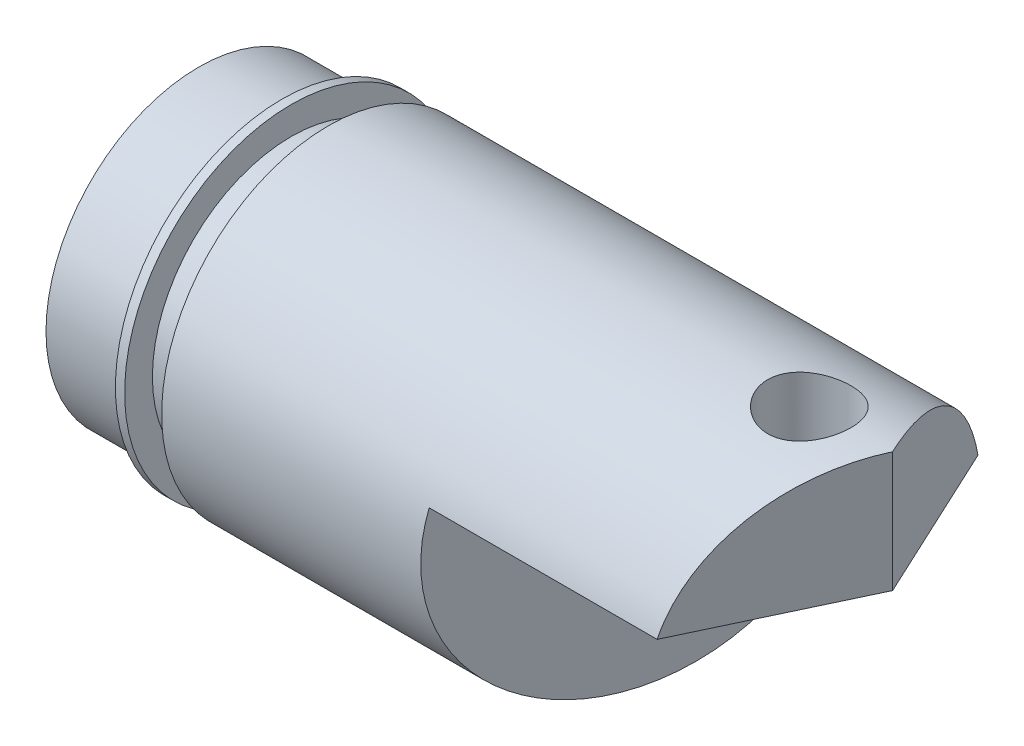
ISO-10303-21;
HEADER;
FILE_DESCRIPTION(('STEP AP214'),'2;1');
FILE_NAME('part.step','',(''),(''),'','','');
FILE_SCHEMA(('AUTOMOTIVE_DESIGN { 1 0 10303 214 1 1 1 1 }'));
ENDSEC;
DATA;
#1=APPLICATION_CONTEXT('core data for automotive mechanical design processes');
#2=APPLICATION_PROTOCOL_DEFINITION('international standard','automotive_design',2000,#1);
#3=PRODUCT_CONTEXT('',#1,'mechanical');
#4=PRODUCT('Part','Part','',(#3));
#5=PRODUCT_RELATED_PRODUCT_CATEGORY('part','',(#4));
#6=PRODUCT_DEFINITION_FORMATION('','',#4);
#7=PRODUCT_DEFINITION_CONTEXT('part definition',#1,'design');
#8=PRODUCT_DEFINITION('design','',#6,#7);
#9=PRODUCT_DEFINITION_SHAPE('','',#8);
#10=(LENGTH_UNIT() NAMED_UNIT(*) SI_UNIT(.MILLI.,.METRE.));
#11=(NAMED_UNIT(*) PLANE_ANGLE_UNIT() SI_UNIT($,.RADIAN.));
#12=(NAMED_UNIT(*) SI_UNIT($,.STERADIAN.) SOLID_ANGLE_UNIT());
#13=UNCERTAINTY_MEASURE_WITH_UNIT(LENGTH_MEASURE(1.E-05),#10,'distance_accuracy_value','');
#14=(GEOMETRIC_REPRESENTATION_CONTEXT(3) GLOBAL_UNCERTAINTY_ASSIGNED_CONTEXT((#13)) GLOBAL_UNIT_ASSIGNED_CONTEXT((#10,
#11,#12)) REPRESENTATION_CONTEXT('',''));
#15=CARTESIAN_POINT('',(0.,0.,0.));
#16=DIRECTION('',(0.,0.,1.));
#17=DIRECTION('',(1.,0.,0.));
#18=AXIS2_PLACEMENT_3D('',#15,#16,#17);
#19=CARTESIAN_POINT('',(150.,0.,0.));
#20=DIRECTION('',(1.,0.,0.));
#21=DIRECTION('',(0.,1.,0.));
#22=AXIS2_PLACEMENT_3D('',#19,#20,#21);
#23=CYLINDRICAL_SURFACE('',#22,36.);
#24=CARTESIAN_POINT('',(28.,0.,0.));
#25=DIRECTION('',(1.,0.,0.));
#26=DIRECTION('',(0.,1.,0.));
#27=AXIS2_PLACEMENT_3D('',#24,#25,#26);
#28=CIRCLE('',#27,36.);
#29=CARTESIAN_POINT('',(28.,36.,0.));
#30=VERTEX_POINT('',#29);
#31=EDGE_CURVE('E148',#30,#30,#28,.T.);
#32=ORIENTED_EDGE('',*,*,#31,.T.);
#33=EDGE_LOOP('',(#32));
#34=FACE_BOUND('',#33,.T.);
#35=CARTESIAN_POINT('',(123.,36.,0.));
#36=CARTESIAN_POINT('',(122.999992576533,36.0000044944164,-0.248708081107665));
#37=CARTESIAN_POINT('',(123.010310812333,35.997418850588,-0.497334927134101));
#38=CARTESIAN_POINT('',(123.05147979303,35.9871583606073,-0.992847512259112));
#39=CARTESIAN_POINT('',(123.082332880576,35.9794829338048,-1.23973304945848));
#40=CARTESIAN_POINT('',(123.164333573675,35.9592469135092,-1.72997199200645));
#41=CARTESIAN_POINT('',(123.215487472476,35.9466848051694,-1.97332427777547));
#42=CARTESIAN_POINT('',(123.337685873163,35.9170178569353,-2.45479492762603));
#43=CARTESIAN_POINT('',(123.408737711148,35.8999113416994,-2.69291132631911));
#44=CARTESIAN_POINT('',(123.570025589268,35.8616556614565,-3.16178775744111));
#45=CARTESIAN_POINT('',(123.660230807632,35.8405129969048,-3.39255893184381));
#46=CARTESIAN_POINT('',(123.859237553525,35.7947291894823,-3.8456782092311));
#47=CARTESIAN_POINT('',(123.968046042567,35.770086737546,-4.06802312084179));
#48=CARTESIAN_POINT('',(124.203389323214,35.7179784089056,-4.50265606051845));
#49=CARTESIAN_POINT('',(124.329916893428,35.6905136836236,-4.71494813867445));
#50=CARTESIAN_POINT('',(124.59990594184,35.6334671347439,-5.12831149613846));
#51=CARTESIAN_POINT('',(124.743375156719,35.6038843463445,-5.3293775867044));
#52=CARTESIAN_POINT('',(125.049040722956,35.5428333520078,-5.72252606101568));
#53=CARTESIAN_POINT('',(125.211534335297,35.5113403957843,-5.91437353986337));
#54=CARTESIAN_POINT('',(125.551872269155,35.4478549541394,-6.2836834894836));
#55=CARTESIAN_POINT('',(125.729709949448,35.4158626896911,-6.46115211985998));
#56=CARTESIAN_POINT('',(126.099727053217,35.3522276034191,-6.80072543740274));
#57=CARTESIAN_POINT('',(126.291913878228,35.3205849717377,-6.96282209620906));
#58=CARTESIAN_POINT('',(126.689224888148,35.2585571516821,-7.27040301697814));
#59=CARTESIAN_POINT('',(126.894344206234,35.2281714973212,-7.41589347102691));
#60=CARTESIAN_POINT('',(127.319482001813,35.1690527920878,-7.69141658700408));
#61=CARTESIAN_POINT('',(127.539680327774,35.1403521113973,-7.82117889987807));
#62=CARTESIAN_POINT('',(127.990522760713,35.0859781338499,-8.06159605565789));
#63=CARTESIAN_POINT('',(128.221162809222,35.0603036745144,-8.17225824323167));
#64=CARTESIAN_POINT('',(128.691379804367,35.0127442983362,-8.37367623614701));
#65=CARTESIAN_POINT('',(128.930957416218,34.9908596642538,-8.46443055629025));
#66=CARTESIAN_POINT('',(129.417309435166,34.9515601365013,-8.62527138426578));
#67=CARTESIAN_POINT('',(129.66408366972,34.9341451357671,-8.69535838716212));
#68=CARTESIAN_POINT('',(130.158003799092,34.9046329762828,-8.81307024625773));
#69=CARTESIAN_POINT('',(130.405043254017,34.8924362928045,-8.86111688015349));
#70=CARTESIAN_POINT('',(130.902476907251,34.8732389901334,-8.93637036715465));
#71=CARTESIAN_POINT('',(131.152871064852,34.8662383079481,-8.96357747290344));
#72=CARTESIAN_POINT('',(131.655115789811,34.8576521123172,-8.99690984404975));
#73=CARTESIAN_POINT('',(131.906966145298,34.8560658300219,-9.00303810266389));
#74=CARTESIAN_POINT('',(132.410267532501,34.8583561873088,-8.99416620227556));
#75=CARTESIAN_POINT('',(132.66171856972,34.8622327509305,-8.97916633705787));
#76=CARTESIAN_POINT('',(133.156210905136,34.8751663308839,-8.92879753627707));
#77=CARTESIAN_POINT('',(133.399307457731,34.8840943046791,-8.89393583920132));
#78=CARTESIAN_POINT('',(133.881709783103,34.9067723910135,-8.80450832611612));
#79=CARTESIAN_POINT('',(134.121014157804,34.9205242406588,-8.74993541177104));
#80=CARTESIAN_POINT('',(134.59405540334,34.9524453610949,-8.62153887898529));
#81=CARTESIAN_POINT('',(134.827793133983,34.9706139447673,-8.54771825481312));
#82=CARTESIAN_POINT('',(135.288184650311,35.0108492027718,-8.38139323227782));
#83=CARTESIAN_POINT('',(135.514838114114,35.0329160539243,-8.28888798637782));
#84=CARTESIAN_POINT('',(135.961813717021,35.0805656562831,-8.08486184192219));
#85=CARTESIAN_POINT('',(136.182049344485,35.1061815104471,-7.97315919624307));
#86=CARTESIAN_POINT('',(136.612364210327,35.1600387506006,-7.73219945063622));
#87=CARTESIAN_POINT('',(136.822443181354,35.1882802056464,-7.60294188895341));
#88=CARTESIAN_POINT('',(137.231142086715,35.2466158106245,-7.32774541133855));
#89=CARTESIAN_POINT('',(137.4297604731,35.2767102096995,-7.18180424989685));
#90=CARTESIAN_POINT('',(137.814271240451,35.3379359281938,-6.87421762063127));
#91=CARTESIAN_POINT('',(138.000163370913,35.3690672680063,-6.71257184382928));
#92=CARTESIAN_POINT('',(138.363173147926,35.4324303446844,-6.36978113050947));
#93=CARTESIAN_POINT('',(138.539888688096,35.4646681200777,-6.18821121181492));
#94=CARTESIAN_POINT('',(138.877440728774,35.528463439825,-5.81075838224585));
#95=CARTESIAN_POINT('',(139.038277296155,35.5600209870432,-5.6148755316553));
#96=CARTESIAN_POINT('',(139.342977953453,35.6215812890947,-5.21007238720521));
#97=CARTESIAN_POINT('',(139.486840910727,35.6515839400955,-5.0011512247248));
#98=CARTESIAN_POINT('',(139.756548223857,35.7091959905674,-4.57167947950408));
#99=CARTESIAN_POINT('',(139.882393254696,35.7368054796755,-4.35112933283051));
#100=CARTESIAN_POINT('',(140.115560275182,35.7889557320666,-3.89905149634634));
#101=CARTESIAN_POINT('',(140.222812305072,35.813484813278,-3.66748635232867));
#102=CARTESIAN_POINT('',(140.417339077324,35.8586481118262,-3.1958482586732));
#103=CARTESIAN_POINT('',(140.504621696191,35.8792838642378,-2.9557787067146));
#104=CARTESIAN_POINT('',(140.658547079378,35.9160806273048,-2.4687616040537));
#105=CARTESIAN_POINT('',(140.725188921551,35.9322414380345,-2.22181374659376));
#106=CARTESIAN_POINT('',(140.837253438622,35.9596175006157,-1.72288121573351));
#107=CARTESIAN_POINT('',(140.882676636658,35.9708328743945,-1.47089666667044));
#108=CARTESIAN_POINT('',(140.951017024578,35.9877707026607,-0.970294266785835));
#109=CARTESIAN_POINT('',(140.974480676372,35.9936264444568,-0.721755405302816));
#110=CARTESIAN_POINT('',(141.000681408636,36.0001680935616,-0.223521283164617));
#111=CARTESIAN_POINT('',(141.003418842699,36.0008540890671,0.0261739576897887));
#112=CARTESIAN_POINT('',(140.988144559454,35.997037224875,0.52486719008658));
#113=CARTESIAN_POINT('',(140.970134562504,35.9925347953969,0.773865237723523));
#114=CARTESIAN_POINT('',(140.913523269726,35.9784678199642,1.2693632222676));
#115=CARTESIAN_POINT('',(140.874922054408,35.9689032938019,1.51586316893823));
#116=CARTESIAN_POINT('',(140.778189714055,35.9451589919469,2.00090506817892));
#117=CARTESIAN_POINT('',(140.720361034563,35.9310507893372,2.23951094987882));
#118=CARTESIAN_POINT('',(140.585483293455,35.8985548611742,2.71101953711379));
#119=CARTESIAN_POINT('',(140.508427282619,35.8801655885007,2.94392014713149));
#120=CARTESIAN_POINT('',(140.335725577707,35.8396049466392,3.40230033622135));
#121=CARTESIAN_POINT('',(140.240085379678,35.8174346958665,3.62778208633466));
#122=CARTESIAN_POINT('',(140.030868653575,35.7698822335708,4.07001336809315));
#123=CARTESIAN_POINT('',(139.917285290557,35.744498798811,4.28675953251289));
#124=CARTESIAN_POINT('',(139.670892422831,35.6907255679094,4.71372564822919));
#125=CARTESIAN_POINT('',(139.537783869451,35.6622912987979,4.92376743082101));
#126=CARTESIAN_POINT('',(139.254728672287,35.6035380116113,5.33203934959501));
#127=CARTESIAN_POINT('',(139.104774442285,35.5732181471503,5.5302641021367));
#128=CARTESIAN_POINT('',(138.789059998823,35.511510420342,5.91357111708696));
#129=CARTESIAN_POINT('',(138.623297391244,35.4801223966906,6.09865138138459));
#130=CARTESIAN_POINT('',(138.277141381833,35.4171365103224,6.45438329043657));
#131=CARTESIAN_POINT('',(138.096754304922,35.3855387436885,6.625041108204));
#132=CARTESIAN_POINT('',(137.717750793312,35.3221872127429,6.95499967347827));
#133=CARTESIAN_POINT('',(137.518791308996,35.2904493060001,7.11390970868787));
#134=CARTESIAN_POINT('',(137.108041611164,35.2285522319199,7.41435316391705));
#135=CARTESIAN_POINT('',(136.896256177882,35.1983924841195,7.55589299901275));
#136=CARTESIAN_POINT('',(136.46112296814,35.1405053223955,7.82069490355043));
#137=CARTESIAN_POINT('',(136.237770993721,35.1127788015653,7.94395027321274));
#138=CARTESIAN_POINT('',(135.781190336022,35.0606046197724,8.17114386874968));
#139=CARTESIAN_POINT('',(135.547965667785,35.0361556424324,8.27508985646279));
#140=CARTESIAN_POINT('',(135.074567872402,34.9913957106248,8.46235474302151));
#141=CARTESIAN_POINT('',(134.834442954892,34.9710615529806,8.5457899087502));
#142=CARTESIAN_POINT('',(134.347674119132,34.934977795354,8.69212361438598));
#143=CARTESIAN_POINT('',(134.101030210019,34.9192281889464,8.75502218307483));
#144=CARTESIAN_POINT('',(133.603082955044,34.8928084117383,8.85973145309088));
#145=CARTESIAN_POINT('',(133.351780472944,34.8821373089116,8.90154602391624));
#146=CARTESIAN_POINT('',(132.846367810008,34.8662093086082,8.96373158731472));
#147=CARTESIAN_POINT('',(132.592257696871,34.8609522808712,8.98410309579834));
#148=CARTESIAN_POINT('',(132.090497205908,34.8560908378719,9.00294499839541));
#149=CARTESIAN_POINT('',(131.842871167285,34.856328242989,9.00202825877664));
#150=CARTESIAN_POINT('',(131.348600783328,34.8620604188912,8.97980375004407));
#151=CARTESIAN_POINT('',(131.101956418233,34.8675550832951,8.95849639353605));
#152=CARTESIAN_POINT('',(130.611432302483,34.8836355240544,8.89567423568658));
#153=CARTESIAN_POINT('',(130.367552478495,34.8942211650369,8.85415997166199));
#154=CARTESIAN_POINT('',(129.88427908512,34.9201667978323,8.7512719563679));
#155=CARTESIAN_POINT('',(129.644885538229,34.935526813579,8.68989810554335));
#156=CARTESIAN_POINT('',(129.173704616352,34.970460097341,8.54822807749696));
#157=CARTESIAN_POINT('',(128.941879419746,34.9900067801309,8.46805100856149));
#158=CARTESIAN_POINT('',(128.485757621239,35.0328177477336,8.289157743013));
#159=CARTESIAN_POINT('',(128.261463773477,35.0560833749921,8.19043484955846));
#160=CARTESIAN_POINT('',(127.821961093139,35.105673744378,7.97520272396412));
#161=CARTESIAN_POINT('',(127.606751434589,35.1319982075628,7.85869511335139));
#162=CARTESIAN_POINT('',(127.186739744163,35.1869878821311,7.60869624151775));
#163=CARTESIAN_POINT('',(126.981938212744,35.2156532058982,7.47520416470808));
#164=CARTESIAN_POINT('',(126.5788222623,35.2753227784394,7.18843517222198));
#165=CARTESIAN_POINT('',(126.380816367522,35.3063685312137,7.03473303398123));
#166=CARTESIAN_POINT('',(125.998377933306,35.369250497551,6.71142551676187));
#167=CARTESIAN_POINT('',(125.813945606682,35.401086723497,6.54181988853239));
#168=CARTESIAN_POINT('',(125.459807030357,35.4646833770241,6.18777665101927));
#169=CARTESIAN_POINT('',(125.290104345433,35.4964437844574,6.00333547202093));
#170=CARTESIAN_POINT('',(124.966599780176,35.5590147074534,5.62085561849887));
#171=CARTESIAN_POINT('',(124.812797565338,35.5898252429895,5.42281723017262));
#172=CARTESIAN_POINT('',(124.519465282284,35.6502091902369,5.0106629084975));
#173=CARTESIAN_POINT('',(124.380249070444,35.6797495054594,4.79631855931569));
#174=CARTESIAN_POINT('',(124.120460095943,35.7361311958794,4.35638506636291));
#175=CARTESIAN_POINT('',(123.999880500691,35.7629735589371,4.13080008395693));
#176=CARTESIAN_POINT('',(123.778275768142,35.8131971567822,3.66995539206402));
#177=CARTESIAN_POINT('',(123.677242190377,35.8365798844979,3.43469991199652));
#178=CARTESIAN_POINT('',(123.495500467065,35.8792244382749,2.95618502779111));
#179=CARTESIAN_POINT('',(123.414789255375,35.8984868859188,2.71292683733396));
#180=CARTESIAN_POINT('',(123.230650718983,35.9428574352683,2.06666445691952));
#181=CARTESIAN_POINT('',(123.144306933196,35.9641522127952,1.65838720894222));
#182=CARTESIAN_POINT('',(123.028989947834,35.9927192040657,0.833330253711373));
#183=CARTESIAN_POINT('',(123.000012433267,35.9999924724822,0.416551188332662));
#184=CARTESIAN_POINT('',(123.,36.,0.));
#185=B_SPLINE_CURVE_WITH_KNOTS('',3,(#35,#36,#37,#38,#39,#40,#41,#42,#43,#44,#45,#46,#47,#48,
#49,#50,#51,#52,#53,#54,#55,#56,#57,#58,#59,#60,#61,#62,#63,#64,#65,#66,#67,#68,#69,#70,#71,#72,
#73,#74,#75,#76,#77,#78,#79,#80,#81,#82,#83,#84,#85,#86,#87,#88,#89,#90,#91,#92,#93,#94,#95,#96,
#97,#98,#99,#100,#101,#102,#103,#104,#105,#106,#107,#108,#109,#110,#111,#112,#113,#114,#115,
#116,#117,#118,#119,#120,#121,#122,#123,#124,#125,#126,#127,#128,#129,#130,#131,#132,#133,#134,
#135,#136,#137,#138,#139,#140,#141,#142,#143,#144,#145,#146,#147,#148,#149,#150,#151,#152,#153,
#154,#155,#156,#157,#158,#159,#160,#161,#162,#163,#164,#165,#166,#167,#168,#169,#170,#171,#172,
#173,#174,#175,#176,#177,#178,#179,#180,#181,#182,#183,#184),.UNSPECIFIED.,.T.,.F.,(4,2,2,2,2,2,
2,2,2,2,2,2,2,2,2,2,2,2,2,2,2,2,2,2,2,2,2,2,2,2,2,2,2,2,2,2,2,2,2,2,2,2,2,2,2,2,2,2,2,2,2,2,2,2,
2,2,2,2,2,2,2,2,2,2,2,2,2,2,2,2,2,2,2,2,4),(0.,0.745757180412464,1.49159945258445,
2.23767311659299,2.98402221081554,3.72917925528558,4.4746157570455,5.21974933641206,
5.96522451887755,6.72448606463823,7.4834206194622,8.24274938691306,9.00179408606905,
9.77244404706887,10.5427970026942,11.3132074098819,12.0835993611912,12.8385611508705,
13.5935137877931,14.3483592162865,15.1031941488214,15.8395645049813,16.57620030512,
17.3127215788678,18.0492762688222,18.7932326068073,19.5372085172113,20.2812846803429,
21.0253754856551,21.790712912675,22.5560471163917,23.321432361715,24.0867889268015,
24.8549655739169,25.6228387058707,26.3907461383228,27.1586346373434,27.9068622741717,
28.6550771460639,29.4032299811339,30.1513798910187,30.8882782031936,31.6254432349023,
32.3623905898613,33.0996193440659,33.8496229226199,34.5999656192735,35.3504221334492,
36.1005557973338,36.8694474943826,37.6380543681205,38.4069421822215,39.1755202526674,
39.9396355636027,40.7037498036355,41.4677237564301,42.2316793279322,42.9736694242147,
43.7156445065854,44.4575998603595,45.1995589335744,45.9369393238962,46.6745864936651,
47.4121664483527,48.1497818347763,48.9066360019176,49.6635020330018,50.420550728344,
51.1775834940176,51.9485144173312,52.7191620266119,53.4894761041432,54.2596738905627,
55.5088066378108,56.7578454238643),.UNSPECIFIED.);
#186=CARTESIAN_POINT('',(123.,36.,0.));
#187=VERTEX_POINT('',#186);
#188=EDGE_CURVE('E89',#187,#187,#185,.T.);
#189=ORIENTED_EDGE('',*,*,#188,.T.);
#190=EDGE_LOOP('',(#189));
#191=FACE_BOUND('',#190,.T.);
#192=CARTESIAN_POINT('',(150.,0.,0.));
#193=DIRECTION('',(0.904396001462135,0.,0.426694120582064));
#194=DIRECTION('',(0.426694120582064,0.,-0.904396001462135));
#195=AXIS2_PLACEMENT_3D('',#192,#193,#194);
#196=ELLIPSE('',#195,39.8055718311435,36.);
#197=CARTESIAN_POINT('',(133.683627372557,10.,34.5832329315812));
#198=VERTEX_POINT('',#197);
#199=CARTESIAN_POINT('',(150.,36.,0.));
#200=VERTEX_POINT('',#199);
#201=EDGE_CURVE('E50',#198,#200,#196,.F.);
#202=ORIENTED_EDGE('',*,*,#201,.T.);
#203=CARTESIAN_POINT('',(150.,0.,0.));
#204=DIRECTION('',(0.906307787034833,0.,-0.422618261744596));
#205=DIRECTION('',(0.422618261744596,0.,0.906307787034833));
#206=AXIS2_PLACEMENT_3D('',#203,#204,#205);
#207=ELLIPSE('',#206,39.7216050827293,36.);
#208=CARTESIAN_POINT('',(133.873573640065,10.,-34.5832329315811));
#209=VERTEX_POINT('',#208);
#210=EDGE_CURVE('E78',#200,#209,#207,.F.);
#211=ORIENTED_EDGE('',*,*,#210,.T.);
#212=DIRECTION('',(1.,0.,0.));
#213=VECTOR('',#212,1.);
#214=CARTESIAN_POINT('',(150.,10.,-34.5832329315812));
#215=LINE('',#214,#213);
#216=CARTESIAN_POINT('',(104.586776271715,10.,-34.5832329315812));
#217=VERTEX_POINT('',#216);
#218=EDGE_CURVE('E11',#209,#217,#215,.F.);
#219=ORIENTED_EDGE('',*,*,#218,.T.);
#220=CARTESIAN_POINT('',(94.5000000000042,0.,0.));
#221=DIRECTION('',(-0.96,0.,-0.28));
#222=DIRECTION('',(0.28,0.,-0.96));
#223=AXIS2_PLACEMENT_3D('',#220,#221,#222);
#224=ELLIPSE('',#223,37.5,36.);
#225=CARTESIAN_POINT('',(84.413223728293,9.99999999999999,34.5832329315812));
#226=VERTEX_POINT('',#225);
#227=EDGE_CURVE('E43',#226,#217,#224,.F.);
#228=ORIENTED_EDGE('',*,*,#227,.F.);
#229=DIRECTION('',(1.,0.,0.));
#230=VECTOR('',#229,1.);
#231=CARTESIAN_POINT('',(150.,10.,34.5832329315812));
#232=LINE('',#231,#230);
#233=EDGE_CURVE('E57',#226,#198,#232,.T.);
#234=ORIENTED_EDGE('',*,*,#233,.T.);
#235=EDGE_LOOP('',(#202,#211,#219,#228,#234));
#236=FACE_BOUND('',#235,.T.);
#237=ADVANCED_FACE('F35',(#34,#191,#236),#23,.T.);
#238=CARTESIAN_POINT('',(150.,10.,-36.));
#239=DIRECTION('',(0.,-1.,0.));
#240=DIRECTION('',(0.,0.,-1.));
#241=AXIS2_PLACEMENT_3D('',#238,#239,#240);
#242=PLANE('',#241);
#243=CARTESIAN_POINT('',(132.,10.,0.));
#244=DIRECTION('',(0.,1.,0.));
#245=DIRECTION('',(0.,0.,1.));
#246=AXIS2_PLACEMENT_3D('',#243,#244,#245);
#247=CIRCLE('',#246,9.);
#248=CARTESIAN_POINT('',(132.,10.,9.));
#249=VERTEX_POINT('',#248);
#250=EDGE_CURVE('E86',#249,#249,#247,.T.);
#251=ORIENTED_EDGE('',*,*,#250,.T.);
#252=EDGE_LOOP('',(#251));
#253=FACE_BOUND('',#252,.T.);
#254=ORIENTED_EDGE('',*,*,#218,.F.);
#255=DIRECTION('',(0.422618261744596,0.,0.906307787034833));
#256=VECTOR('',#255,1.);
#257=CARTESIAN_POINT('',(150.,10.,0.));
#258=LINE('',#257,#256);
#259=CARTESIAN_POINT('',(150.,10.,0.));
#260=VERTEX_POINT('',#259);
#261=EDGE_CURVE('E73',#209,#260,#258,.T.);
#262=ORIENTED_EDGE('',*,*,#261,.T.);
#263=DIRECTION('',(-0.426694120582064,0.,0.904396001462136));
#264=VECTOR('',#263,1.);
#265=CARTESIAN_POINT('',(127.125341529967,10.,48.4837935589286));
#266=LINE('',#265,#264);
#267=EDGE_CURVE('E68',#260,#198,#266,.T.);
#268=ORIENTED_EDGE('',*,*,#267,.T.);
#269=ORIENTED_EDGE('',*,*,#233,.F.);
#270=DIRECTION('',(-0.28,0.,0.96));
#271=VECTOR('',#270,1.);
#272=CARTESIAN_POINT('',(105.000000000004,10.,-36.));
#273=LINE('',#272,#271);
#274=EDGE_CURVE('E96',#217,#226,#273,.T.);
#275=ORIENTED_EDGE('',*,*,#274,.F.);
#276=EDGE_LOOP('',(#254,#262,#268,#269,#275));
#277=FACE_BOUND('',#276,.T.);
#278=ADVANCED_FACE('F81',(#253,#277),#242,.T.);
#279=CARTESIAN_POINT('',(150.,0.,0.));
#280=DIRECTION('',(1.,0.,0.));
#281=DIRECTION('',(0.,1.,0.));
#282=AXIS2_PLACEMENT_3D('',#279,#280,#281);
#283=CYLINDRICAL_SURFACE('',#282,33.);
#284=CARTESIAN_POINT('',(0.,0.,0.));
#285=DIRECTION('',(1.,0.,0.));
#286=DIRECTION('',(0.,1.,0.));
#287=AXIS2_PLACEMENT_3D('',#284,#285,#286);
#288=CIRCLE('',#287,33.);
#289=CARTESIAN_POINT('',(0.,33.,0.));
#290=VERTEX_POINT('',#289);
#291=EDGE_CURVE('E153',#290,#290,#288,.T.);
#292=ORIENTED_EDGE('',*,*,#291,.T.);
#293=EDGE_LOOP('',(#292));
#294=FACE_BOUND('',#293,.T.);
#295=CARTESIAN_POINT('',(18.,0.,0.));
#296=DIRECTION('',(1.,0.,0.));
#297=DIRECTION('',(0.,1.,0.));
#298=AXIS2_PLACEMENT_3D('',#295,#296,#297);
#299=CIRCLE('',#298,33.);
#300=CARTESIAN_POINT('',(18.,33.,0.));
#301=VERTEX_POINT('',#300);
#302=EDGE_CURVE('E181',#301,#301,#299,.T.);
#303=ORIENTED_EDGE('',*,*,#302,.F.);
#304=EDGE_LOOP('',(#303));
#305=FACE_BOUND('',#304,.T.);
#306=ADVANCED_FACE('F37',(#294,#305),#283,.T.);
#307=CARTESIAN_POINT('',(0.,21.,0.));
#308=DIRECTION('',(-1.,0.,0.));
#309=DIRECTION('',(0.,-1.,0.));
#310=AXIS2_PLACEMENT_3D('',#307,#308,#309);
#311=PLANE('',#310);
#312=CARTESIAN_POINT('',(0.,0.,0.));
#313=DIRECTION('',(1.,0.,0.));
#314=DIRECTION('',(0.,1.,0.));
#315=AXIS2_PLACEMENT_3D('',#312,#313,#314);
#316=CIRCLE('',#315,21.);
#317=CARTESIAN_POINT('',(0.,21.,0.));
#318=VERTEX_POINT('',#317);
#319=EDGE_CURVE('E156',#318,#318,#316,.T.);
#320=ORIENTED_EDGE('',*,*,#319,.T.);
#321=EDGE_LOOP('',(#320));
#322=FACE_BOUND('',#321,.T.);
#323=ORIENTED_EDGE('',*,*,#291,.F.);
#324=EDGE_LOOP('',(#323));
#325=FACE_BOUND('',#324,.T.);
#326=ADVANCED_FACE('F187',(#322,#325),#311,.T.);
#327=CARTESIAN_POINT('',(150.,0.,0.));
#328=DIRECTION('',(1.,0.,0.));
#329=DIRECTION('',(0.,1.,0.));
#330=AXIS2_PLACEMENT_3D('',#327,#328,#329);
#331=CYLINDRICAL_SURFACE('',#330,21.);
#332=CARTESIAN_POINT('',(36.,0.,0.));
#333=DIRECTION('',(1.,0.,0.));
#334=DIRECTION('',(0.,1.,0.));
#335=AXIS2_PLACEMENT_3D('',#332,#333,#334);
#336=CIRCLE('',#335,21.);
#337=CARTESIAN_POINT('',(36.,21.,0.));
#338=VERTEX_POINT('',#337);
#339=EDGE_CURVE('E161',#338,#338,#336,.T.);
#340=ORIENTED_EDGE('',*,*,#339,.T.);
#341=EDGE_LOOP('',(#340));
#342=FACE_BOUND('',#341,.T.);
#343=ORIENTED_EDGE('',*,*,#319,.F.);
#344=EDGE_LOOP('',(#343));
#345=FACE_BOUND('',#344,.T.);
#346=ADVANCED_FACE('F192',(#342,#345),#331,.F.);
#347=CARTESIAN_POINT('',(36.,18.9999999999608,0.));
#348=DIRECTION('',(-1.,0.,0.));
#349=DIRECTION('',(0.,-1.,0.));
#350=AXIS2_PLACEMENT_3D('',#347,#348,#349);
#351=PLANE('',#350);
#352=CARTESIAN_POINT('',(36.,0.,0.));
#353=DIRECTION('',(1.,0.,0.));
#354=DIRECTION('',(0.,1.,0.));
#355=AXIS2_PLACEMENT_3D('',#352,#353,#354);
#356=CIRCLE('',#355,18.9999999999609);
#357=CARTESIAN_POINT('',(36.,18.9999999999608,0.));
#358=VERTEX_POINT('',#357);
#359=EDGE_CURVE('E164',#358,#358,#356,.T.);
#360=ORIENTED_EDGE('',*,*,#359,.T.);
#361=EDGE_LOOP('',(#360));
#362=FACE_BOUND('',#361,.T.);
#363=ORIENTED_EDGE('',*,*,#339,.F.);
#364=EDGE_LOOP('',(#363));
#365=FACE_BOUND('',#364,.T.);
#366=ADVANCED_FACE('F199',(#362,#365),#351,.T.);
#367=CARTESIAN_POINT('',(36.,0.,0.));
#368=DIRECTION('',(-1.,0.,0.));
#369=DIRECTION('',(0.,-1.,0.));
#370=AXIS2_PLACEMENT_3D('',#367,#368,#369);
#371=CONICAL_SURFACE('',#370,18.9999999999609,0.128467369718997);
#372=CARTESIAN_POINT('',(67.9217143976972,0.,0.));
#373=DIRECTION('',(1.,0.,0.));
#374=DIRECTION('',(0.,1.,0.));
#375=AXIS2_PLACEMENT_3D('',#372,#373,#374);
#376=CIRCLE('',#375,14.8763911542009);
#377=CARTESIAN_POINT('',(67.9217143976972,14.8763911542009,0.));
#378=VERTEX_POINT('',#377);
#379=EDGE_CURVE('E167',#378,#378,#376,.T.);
#380=ORIENTED_EDGE('',*,*,#379,.T.);
#381=EDGE_LOOP('',(#380));
#382=FACE_BOUND('',#381,.T.);
#383=ORIENTED_EDGE('',*,*,#359,.F.);
#384=EDGE_LOOP('',(#383));
#385=FACE_BOUND('',#384,.T.);
#386=ADVANCED_FACE('F137',(#382,#385),#371,.F.);
#387=CARTESIAN_POINT('',(65.9999999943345,0.,0.));
#388=DIRECTION('',(1.,0.,0.));
#389=DIRECTION('',(0.,1.,0.));
#390=AXIS2_PLACEMENT_3D('',#387,#388,#389);
#391=SPHERICAL_SURFACE('',#390,15.0000000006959);
#392=ORIENTED_EDGE('',*,*,#379,.F.);
#393=EDGE_LOOP('',(#392));
#394=FACE_BOUND('',#393,.T.);
#395=ADVANCED_FACE('F132',(#394),#391,.F.);
#396=CARTESIAN_POINT('',(28.,30.,0.));
#397=DIRECTION('',(-1.,0.,0.));
#398=DIRECTION('',(0.,-1.,0.));
#399=AXIS2_PLACEMENT_3D('',#396,#397,#398);
#400=PLANE('',#399);
#401=CARTESIAN_POINT('',(28.,0.,0.));
#402=DIRECTION('',(1.,0.,0.));
#403=DIRECTION('',(0.,1.,0.));
#404=AXIS2_PLACEMENT_3D('',#401,#402,#403);
#405=CIRCLE('',#404,30.);
#406=CARTESIAN_POINT('',(28.,30.,0.));
#407=VERTEX_POINT('',#406);
#408=EDGE_CURVE('E171',#407,#407,#405,.T.);
#409=ORIENTED_EDGE('',*,*,#408,.T.);
#410=EDGE_LOOP('',(#409));
#411=FACE_BOUND('',#410,.T.);
#412=ORIENTED_EDGE('',*,*,#31,.F.);
#413=EDGE_LOOP('',(#412));
#414=FACE_BOUND('',#413,.T.);
#415=ADVANCED_FACE('F129',(#411,#414),#400,.T.);
#416=CARTESIAN_POINT('',(150.,0.,0.));
#417=DIRECTION('',(1.,0.,0.));
#418=DIRECTION('',(0.,1.,0.));
#419=AXIS2_PLACEMENT_3D('',#416,#417,#418);
#420=CYLINDRICAL_SURFACE('',#419,30.);
#421=CARTESIAN_POINT('',(20.,0.,0.));
#422=DIRECTION('',(1.,0.,0.));
#423=DIRECTION('',(0.,1.,0.));
#424=AXIS2_PLACEMENT_3D('',#421,#422,#423);
#425=CIRCLE('',#424,30.);
#426=CARTESIAN_POINT('',(20.,30.,0.));
#427=VERTEX_POINT('',#426);
#428=EDGE_CURVE('E173',#427,#427,#425,.T.);
#429=ORIENTED_EDGE('',*,*,#428,.T.);
#430=EDGE_LOOP('',(#429));
#431=FACE_BOUND('',#430,.T.);
#432=ORIENTED_EDGE('',*,*,#408,.F.);
#433=EDGE_LOOP('',(#432));
#434=FACE_BOUND('',#433,.T.);
#435=ADVANCED_FACE('F126',(#431,#434),#420,.T.);
#436=CARTESIAN_POINT('',(20.,36.,0.));
#437=DIRECTION('',(1.,0.,0.));
#438=DIRECTION('',(0.,1.,0.));
#439=AXIS2_PLACEMENT_3D('',#436,#437,#438);
#440=PLANE('',#439);
#441=CARTESIAN_POINT('',(20.,0.,0.));
#442=DIRECTION('',(1.,0.,0.));
#443=DIRECTION('',(0.,1.,0.));
#444=AXIS2_PLACEMENT_3D('',#441,#442,#443);
#445=CIRCLE('',#444,36.);
#446=CARTESIAN_POINT('',(20.,36.,0.));
#447=VERTEX_POINT('',#446);
#448=EDGE_CURVE('E176',#447,#447,#445,.T.);
#449=ORIENTED_EDGE('',*,*,#448,.T.);
#450=EDGE_LOOP('',(#449));
#451=FACE_BOUND('',#450,.T.);
#452=ORIENTED_EDGE('',*,*,#428,.F.);
#453=EDGE_LOOP('',(#452));
#454=FACE_BOUND('',#453,.T.);
#455=ADVANCED_FACE('F122',(#451,#454),#440,.T.);
#456=CARTESIAN_POINT('',(150.,0.,0.));
#457=DIRECTION('',(1.,0.,0.));
#458=DIRECTION('',(0.,1.,0.));
#459=AXIS2_PLACEMENT_3D('',#456,#457,#458);
#460=CYLINDRICAL_SURFACE('',#459,36.);
#461=CARTESIAN_POINT('',(18.,0.,0.));
#462=DIRECTION('',(1.,0.,0.));
#463=DIRECTION('',(0.,1.,0.));
#464=AXIS2_PLACEMENT_3D('',#461,#462,#463);
#465=CIRCLE('',#464,36.);
#466=CARTESIAN_POINT('',(18.,36.,0.));
#467=VERTEX_POINT('',#466);
#468=EDGE_CURVE('E179',#467,#467,#465,.T.);
#469=ORIENTED_EDGE('',*,*,#468,.T.);
#470=EDGE_LOOP('',(#469));
#471=FACE_BOUND('',#470,.T.);
#472=ORIENTED_EDGE('',*,*,#448,.F.);
#473=EDGE_LOOP('',(#472));
#474=FACE_BOUND('',#473,.T.);
#475=ADVANCED_FACE('F118',(#471,#474),#460,.T.);
#476=CARTESIAN_POINT('',(18.,33.,0.));
#477=DIRECTION('',(-1.,0.,0.));
#478=DIRECTION('',(0.,-1.,0.));
#479=AXIS2_PLACEMENT_3D('',#476,#477,#478);
#480=PLANE('',#479);
#481=ORIENTED_EDGE('',*,*,#302,.T.);
#482=EDGE_LOOP('',(#481));
#483=FACE_BOUND('',#482,.T.);
#484=ORIENTED_EDGE('',*,*,#468,.F.);
#485=EDGE_LOOP('',(#484));
#486=FACE_BOUND('',#485,.T.);
#487=ADVANCED_FACE('F114',(#483,#486),#480,.T.);
#488=CARTESIAN_POINT('',(105.000000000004,-36.,-36.));
#489=DIRECTION('',(-0.96,0.,-0.28));
#490=DIRECTION('',(-0.28,0.,0.96));
#491=AXIS2_PLACEMENT_3D('',#488,#489,#490);
#492=PLANE('',#491);
#493=ORIENTED_EDGE('',*,*,#227,.T.);
#494=ORIENTED_EDGE('',*,*,#274,.T.);
#495=EDGE_LOOP('',(#493,#494));
#496=FACE_BOUND('',#495,.T.);
#497=ADVANCED_FACE('F106',(#496),#492,.F.);
#498=CARTESIAN_POINT('',(132.,36.,0.));
#499=DIRECTION('',(0.,-1.,0.));
#500=DIRECTION('',(0.,0.,-1.));
#501=AXIS2_PLACEMENT_3D('',#498,#499,#500);
#502=CYLINDRICAL_SURFACE('',#501,9.);
#503=ORIENTED_EDGE('',*,*,#188,.F.);
#504=EDGE_LOOP('',(#503));
#505=FACE_BOUND('',#504,.T.);
#506=ORIENTED_EDGE('',*,*,#250,.F.);
#507=EDGE_LOOP('',(#506));
#508=FACE_BOUND('',#507,.T.);
#509=ADVANCED_FACE('F101',(#505,#508),#502,.F.);
#510=CARTESIAN_POINT('',(150.,36.,0.));
#511=DIRECTION('',(0.906307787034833,0.,-0.422618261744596));
#512=DIRECTION('',(-0.422618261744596,0.,-0.906307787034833));
#513=AXIS2_PLACEMENT_3D('',#510,#511,#512);
#514=PLANE('',#513);
#515=DIRECTION('',(0.,-1.,0.));
#516=VECTOR('',#515,1.);
#517=CARTESIAN_POINT('',(150.,36.,0.));
#518=LINE('',#517,#516);
#519=EDGE_CURVE('E71',#200,#260,#518,.T.);
#520=ORIENTED_EDGE('',*,*,#519,.T.);
#521=ORIENTED_EDGE('',*,*,#261,.F.);
#522=ORIENTED_EDGE('',*,*,#210,.F.);
#523=EDGE_LOOP('',(#520,#521,#522));
#524=FACE_BOUND('',#523,.T.);
#525=ADVANCED_FACE('F76',(#524),#514,.T.);
#526=CARTESIAN_POINT('',(127.125341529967,36.,48.4837935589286));
#527=DIRECTION('',(0.904396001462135,0.,0.426694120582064));
#528=DIRECTION('',(0.426694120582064,0.,-0.904396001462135));
#529=AXIS2_PLACEMENT_3D('',#526,#527,#528);
#530=PLANE('',#529);
#531=ORIENTED_EDGE('',*,*,#267,.F.);
#532=ORIENTED_EDGE('',*,*,#519,.F.);
#533=ORIENTED_EDGE('',*,*,#201,.F.);
#534=EDGE_LOOP('',(#531,#532,#533));
#535=FACE_BOUND('',#534,.T.);
#536=ADVANCED_FACE('F70',(#535),#530,.T.);
#537=CLOSED_SHELL('',(#237,#278,#306,#326,#346,#366,#386,#395,#415,#435,#455,#475,#487,#497,
#509,#525,#536));
#538=MANIFOLD_SOLID_BREP('B2',#537);
#539=ADVANCED_BREP_SHAPE_REPRESENTATION('',(#18,#538),#14);
#540=SHAPE_DEFINITION_REPRESENTATION(#9,#539);
ENDSEC;
END-ISO-10303-21;
